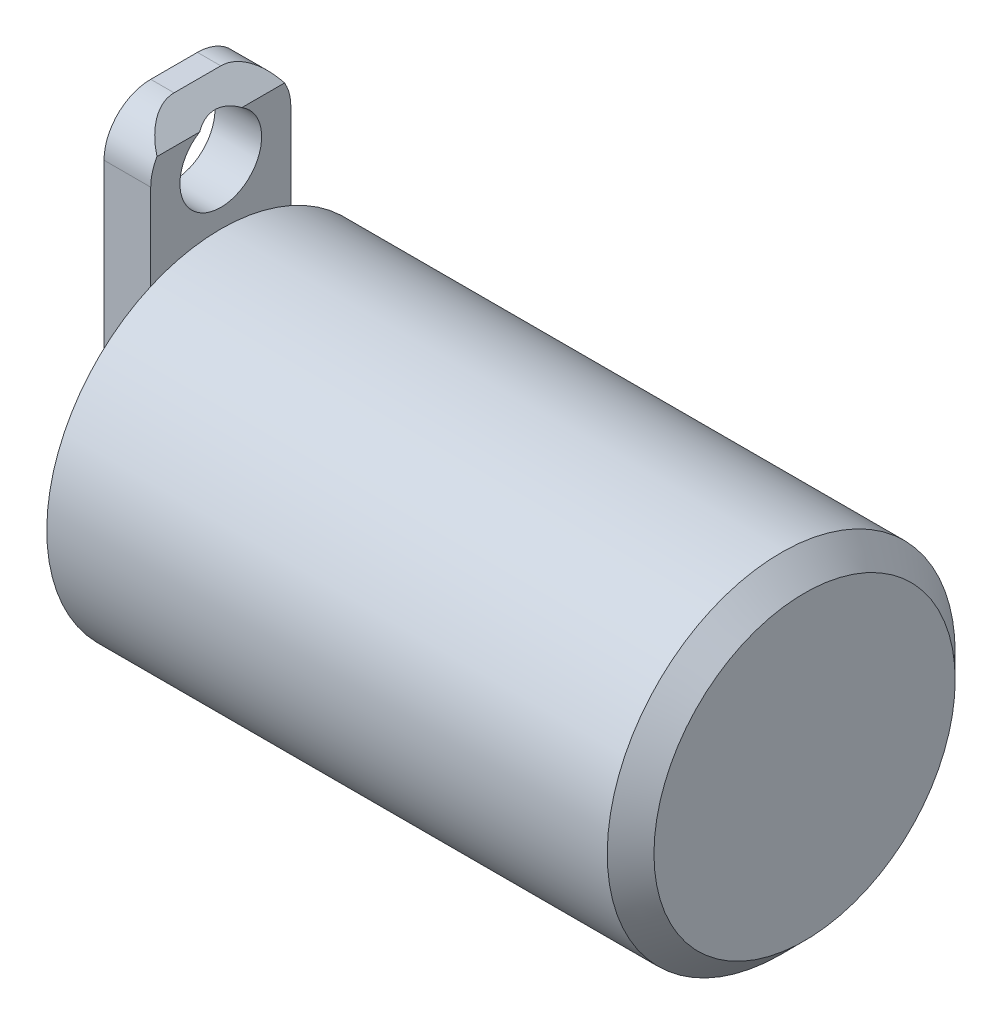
ISO-10303-21;
HEADER;
FILE_DESCRIPTION(('STEP AP214'),'2;1');
FILE_NAME('part.step','',(''),(''),'','','');
FILE_SCHEMA(('AUTOMOTIVE_DESIGN { 1 0 10303 214 1 1 1 1 }'));
ENDSEC;
DATA;
#1=APPLICATION_CONTEXT('core data for automotive mechanical design processes');
#2=APPLICATION_PROTOCOL_DEFINITION('international standard','automotive_design',2000,#1);
#3=PRODUCT_CONTEXT('',#1,'mechanical');
#4=PRODUCT('Part','Part','',(#3));
#5=PRODUCT_RELATED_PRODUCT_CATEGORY('part','',(#4));
#6=PRODUCT_DEFINITION_FORMATION('','',#4);
#7=PRODUCT_DEFINITION_CONTEXT('part definition',#1,'design');
#8=PRODUCT_DEFINITION('design','',#6,#7);
#9=PRODUCT_DEFINITION_SHAPE('','',#8);
#10=(LENGTH_UNIT() NAMED_UNIT(*) SI_UNIT(.MILLI.,.METRE.));
#11=(NAMED_UNIT(*) PLANE_ANGLE_UNIT() SI_UNIT($,.RADIAN.));
#12=(NAMED_UNIT(*) SI_UNIT($,.STERADIAN.) SOLID_ANGLE_UNIT());
#13=UNCERTAINTY_MEASURE_WITH_UNIT(LENGTH_MEASURE(1.E-05),#10,'distance_accuracy_value','');
#14=(GEOMETRIC_REPRESENTATION_CONTEXT(3) GLOBAL_UNCERTAINTY_ASSIGNED_CONTEXT((#13)) GLOBAL_UNIT_ASSIGNED_CONTEXT((#10,
#11,#12)) REPRESENTATION_CONTEXT('',''));
#15=CARTESIAN_POINT('',(0.,0.,0.));
#16=DIRECTION('',(0.,0.,1.));
#17=DIRECTION('',(1.,0.,0.));
#18=AXIS2_PLACEMENT_3D('',#15,#16,#17);
#19=CARTESIAN_POINT('',(0.,0.,0.));
#20=DIRECTION('',(1.,0.,0.));
#21=DIRECTION('',(0.,0.,-1.));
#22=AXIS2_PLACEMENT_3D('',#19,#20,#21);
#23=PLANE('',#22);
#24=DIRECTION('',(0.,-1.,0.));
#25=VECTOR('',#24,1.);
#26=CARTESIAN_POINT('',(0.,21.,-6.));
#27=LINE('',#26,#25);
#28=CARTESIAN_POINT('',(0.,13.6385483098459,-6.));
#29=VERTEX_POINT('',#28);
#30=CARTESIAN_POINT('',(0.,0.,-6.));
#31=VERTEX_POINT('',#30);
#32=EDGE_CURVE('E43',#29,#31,#27,.T.);
#33=ORIENTED_EDGE('',*,*,#32,.F.);
#34=CARTESIAN_POINT('',(0.,0.,0.));
#35=DIRECTION('',(1.,0.,0.));
#36=DIRECTION('',(0.,0.,-1.));
#37=AXIS2_PLACEMENT_3D('',#34,#35,#36);
#38=CIRCLE('',#37,14.9);
#39=CARTESIAN_POINT('',(0.,13.6385483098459,6.));
#40=VERTEX_POINT('',#39);
#41=EDGE_CURVE('E142',#40,#29,#38,.T.);
#42=ORIENTED_EDGE('',*,*,#41,.F.);
#43=DIRECTION('',(0.,1.,0.));
#44=VECTOR('',#43,1.);
#45=CARTESIAN_POINT('',(0.,0.,6.));
#46=LINE('',#45,#44);
#47=CARTESIAN_POINT('',(0.,0.,6.));
#48=VERTEX_POINT('',#47);
#49=EDGE_CURVE('E165',#48,#40,#46,.T.);
#50=ORIENTED_EDGE('',*,*,#49,.F.);
#51=DIRECTION('',(0.,0.,1.));
#52=VECTOR('',#51,1.);
#53=CARTESIAN_POINT('',(0.,0.,0.));
#54=LINE('',#53,#52);
#55=EDGE_CURVE('E57',#31,#48,#54,.T.);
#56=ORIENTED_EDGE('',*,*,#55,.F.);
#57=EDGE_LOOP('',(#33,#42,#50,#56));
#58=FACE_BOUND('',#57,.T.);
#59=ADVANCED_FACE('F35',(#58),#23,.F.);
#60=CARTESIAN_POINT('',(50.,0.,0.));
#61=DIRECTION('',(-1.,0.,0.));
#62=DIRECTION('',(0.,0.,1.));
#63=AXIS2_PLACEMENT_3D('',#60,#61,#62);
#64=CYLINDRICAL_SURFACE('',#63,14.9);
#65=CARTESIAN_POINT('',(48.,0.,0.));
#66=DIRECTION('',(1.,0.,0.));
#67=DIRECTION('',(0.,0.,-1.));
#68=AXIS2_PLACEMENT_3D('',#65,#66,#67);
#69=CIRCLE('',#68,14.9);
#70=CARTESIAN_POINT('',(48.,0.,-14.9));
#71=VERTEX_POINT('',#70);
#72=EDGE_CURVE('E147',#71,#71,#69,.F.);
#73=ORIENTED_EDGE('',*,*,#72,.T.);
#74=EDGE_LOOP('',(#73));
#75=FACE_BOUND('',#74,.T.);
#76=EDGE_CURVE('E143',#29,#40,#38,.T.);
#77=ORIENTED_EDGE('',*,*,#76,.T.);
#78=ORIENTED_EDGE('',*,*,#41,.T.);
#79=EDGE_LOOP('',(#77,#78));
#80=FACE_BOUND('',#79,.T.);
#81=ADVANCED_FACE('F212',(#75,#80),#64,.T.);
#82=CARTESIAN_POINT('',(50.,0.,0.));
#83=DIRECTION('',(1.,0.,0.));
#84=DIRECTION('',(0.,0.,-1.));
#85=AXIS2_PLACEMENT_3D('',#82,#83,#84);
#86=PLANE('',#85);
#87=CARTESIAN_POINT('',(50.,0.,0.));
#88=DIRECTION('',(1.,0.,0.));
#89=DIRECTION('',(0.,0.,-1.));
#90=AXIS2_PLACEMENT_3D('',#87,#88,#89);
#91=CIRCLE('',#90,12.9);
#92=CARTESIAN_POINT('',(50.,0.,-12.9));
#93=VERTEX_POINT('',#92);
#94=EDGE_CURVE('E145',#93,#93,#91,.T.);
#95=ORIENTED_EDGE('',*,*,#94,.T.);
#96=EDGE_LOOP('',(#95));
#97=FACE_BOUND('',#96,.T.);
#98=ADVANCED_FACE('F209',(#97),#86,.T.);
#99=CARTESIAN_POINT('',(50.,0.,0.));
#100=DIRECTION('',(-1.,0.,0.));
#101=DIRECTION('',(0.,0.,1.));
#102=AXIS2_PLACEMENT_3D('',#99,#100,#101);
#103=CONICAL_SURFACE('',#102,12.9,0.785398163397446);
#104=ORIENTED_EDGE('',*,*,#72,.F.);
#105=EDGE_LOOP('',(#104));
#106=FACE_BOUND('',#105,.T.);
#107=ORIENTED_EDGE('',*,*,#94,.F.);
#108=EDGE_LOOP('',(#107));
#109=FACE_BOUND('',#108,.T.);
#110=ADVANCED_FACE('F37',(#106,#109),#103,.T.);
#111=CARTESIAN_POINT('',(-4.,21.,2.));
#112=DIRECTION('',(-1.,0.,0.));
#113=DIRECTION('',(0.,0.,1.));
#114=AXIS2_PLACEMENT_3D('',#111,#112,#113);
#115=PLANE('',#114);
#116=DIRECTION('',(0.,0.,1.));
#117=VECTOR('',#116,1.);
#118=CARTESIAN_POINT('',(-4.,0.,-6.));
#119=LINE('',#118,#117);
#120=CARTESIAN_POINT('',(-4.,0.,-6.));
#121=VERTEX_POINT('',#120);
#122=CARTESIAN_POINT('',(-4.,0.,6.));
#123=VERTEX_POINT('',#122);
#124=EDGE_CURVE('E158',#121,#123,#119,.T.);
#125=ORIENTED_EDGE('',*,*,#124,.T.);
#126=DIRECTION('',(0.,1.,0.));
#127=VECTOR('',#126,1.);
#128=CARTESIAN_POINT('',(-4.,0.,6.));
#129=LINE('',#128,#127);
#130=CARTESIAN_POINT('',(-4.,21.,6.));
#131=VERTEX_POINT('',#130);
#132=EDGE_CURVE('E161',#123,#131,#129,.T.);
#133=ORIENTED_EDGE('',*,*,#132,.T.);
#134=CARTESIAN_POINT('',(-4.,21.,2.));
#135=DIRECTION('',(-1.,0.,0.));
#136=DIRECTION('',(0.,0.,1.));
#137=AXIS2_PLACEMENT_3D('',#134,#135,#136);
#138=CIRCLE('',#137,4.);
#139=CARTESIAN_POINT('',(-4.,25.,1.99999999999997));
#140=VERTEX_POINT('',#139);
#141=EDGE_CURVE('E178',#131,#140,#138,.T.);
#142=ORIENTED_EDGE('',*,*,#141,.T.);
#143=DIRECTION('',(0.,0.,-1.));
#144=VECTOR('',#143,1.);
#145=CARTESIAN_POINT('',(-4.,25.,1.99999999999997));
#146=LINE('',#145,#144);
#147=CARTESIAN_POINT('',(-4.,25.,-1.99999999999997));
#148=VERTEX_POINT('',#147);
#149=EDGE_CURVE('E176',#140,#148,#146,.T.);
#150=ORIENTED_EDGE('',*,*,#149,.T.);
#151=CARTESIAN_POINT('',(-4.,21.,-2.));
#152=DIRECTION('',(-1.,0.,0.));
#153=DIRECTION('',(0.,0.,1.));
#154=AXIS2_PLACEMENT_3D('',#151,#152,#153);
#155=CIRCLE('',#154,4.);
#156=CARTESIAN_POINT('',(-4.,21.,-6.));
#157=VERTEX_POINT('',#156);
#158=EDGE_CURVE('E127',#148,#157,#155,.T.);
#159=ORIENTED_EDGE('',*,*,#158,.T.);
#160=DIRECTION('',(0.,-1.,0.));
#161=VECTOR('',#160,1.);
#162=CARTESIAN_POINT('',(-4.,21.,-6.));
#163=LINE('',#162,#161);
#164=EDGE_CURVE('E173',#157,#121,#163,.T.);
#165=ORIENTED_EDGE('',*,*,#164,.T.);
#166=EDGE_LOOP('',(#125,#133,#142,#150,#159,#165));
#167=FACE_BOUND('',#166,.T.);
#168=CARTESIAN_POINT('',(-4.,20.,0.));
#169=DIRECTION('',(-1.,0.,0.));
#170=DIRECTION('',(0.,0.,1.));
#171=AXIS2_PLACEMENT_3D('',#168,#169,#170);
#172=CIRCLE('',#171,3.5);
#173=CARTESIAN_POINT('',(-4.,20.,3.5));
#174=VERTEX_POINT('',#173);
#175=EDGE_CURVE('E172',#174,#174,#172,.T.);
#176=ORIENTED_EDGE('',*,*,#175,.F.);
#177=EDGE_LOOP('',(#176));
#178=FACE_BOUND('',#177,.T.);
#179=ADVANCED_FACE('F199',(#167,#178),#115,.T.);
#180=CARTESIAN_POINT('',(0.,21.,2.));
#181=DIRECTION('',(-1.,0.,0.));
#182=DIRECTION('',(0.,0.,1.));
#183=AXIS2_PLACEMENT_3D('',#180,#181,#182);
#184=PLANE('',#183);
#185=CARTESIAN_POINT('',(0.,21.,-2.));
#186=DIRECTION('',(-1.,0.,0.));
#187=DIRECTION('',(0.,0.,1.));
#188=AXIS2_PLACEMENT_3D('',#185,#186,#187);
#189=CIRCLE('',#188,4.);
#190=CARTESIAN_POINT('',(0.,23.,-5.46410161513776));
#191=VERTEX_POINT('',#190);
#192=CARTESIAN_POINT('',(0.,21.,-6.));
#193=VERTEX_POINT('',#192);
#194=EDGE_CURVE('E159',#191,#193,#189,.T.);
#195=ORIENTED_EDGE('',*,*,#194,.F.);
#196=DIRECTION('',(0.,0.,1.));
#197=VECTOR('',#196,1.);
#198=CARTESIAN_POINT('',(0.,23.,-14.9));
#199=LINE('',#198,#197);
#200=CARTESIAN_POINT('',(0.,23.,-1.80277563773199));
#201=VERTEX_POINT('',#200);
#202=EDGE_CURVE('E109',#191,#201,#199,.T.);
#203=ORIENTED_EDGE('',*,*,#202,.T.);
#204=CARTESIAN_POINT('',(0.,20.,0.));
#205=DIRECTION('',(-1.,0.,0.));
#206=DIRECTION('',(0.,0.,1.));
#207=AXIS2_PLACEMENT_3D('',#204,#205,#206);
#208=CIRCLE('',#207,3.5);
#209=CARTESIAN_POINT('',(0.,23.,1.80277563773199));
#210=VERTEX_POINT('',#209);
#211=EDGE_CURVE('E181',#201,#210,#208,.T.);
#212=ORIENTED_EDGE('',*,*,#211,.T.);
#213=CARTESIAN_POINT('',(0.,23.,5.46410161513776));
#214=VERTEX_POINT('',#213);
#215=EDGE_CURVE('E49',#210,#214,#199,.T.);
#216=ORIENTED_EDGE('',*,*,#215,.T.);
#217=CARTESIAN_POINT('',(0.,21.,2.));
#218=DIRECTION('',(-1.,0.,0.));
#219=DIRECTION('',(0.,0.,1.));
#220=AXIS2_PLACEMENT_3D('',#217,#218,#219);
#221=CIRCLE('',#220,4.);
#222=CARTESIAN_POINT('',(0.,21.,6.));
#223=VERTEX_POINT('',#222);
#224=EDGE_CURVE('E163',#223,#214,#221,.T.);
#225=ORIENTED_EDGE('',*,*,#224,.F.);
#226=EDGE_CURVE('E170',#40,#223,#46,.T.);
#227=ORIENTED_EDGE('',*,*,#226,.F.);
#228=ORIENTED_EDGE('',*,*,#76,.F.);
#229=EDGE_CURVE('E152',#193,#29,#27,.T.);
#230=ORIENTED_EDGE('',*,*,#229,.F.);
#231=EDGE_LOOP('',(#195,#203,#212,#216,#225,#227,#228,#230));
#232=FACE_BOUND('',#231,.T.);
#233=ADVANCED_FACE('F190',(#232),#184,.F.);
#234=CARTESIAN_POINT('',(-4.,0.,0.));
#235=DIRECTION('',(0.,1.,0.));
#236=DIRECTION('',(0.,0.,1.));
#237=AXIS2_PLACEMENT_3D('',#234,#235,#236);
#238=PLANE('',#237);
#239=ORIENTED_EDGE('',*,*,#55,.T.);
#240=DIRECTION('',(1.,0.,0.));
#241=VECTOR('',#240,1.);
#242=CARTESIAN_POINT('',(-4.,0.,6.));
#243=LINE('',#242,#241);
#244=EDGE_CURVE('E139',#123,#48,#243,.T.);
#245=ORIENTED_EDGE('',*,*,#244,.F.);
#246=ORIENTED_EDGE('',*,*,#124,.F.);
#247=DIRECTION('',(1.,0.,0.));
#248=VECTOR('',#247,1.);
#249=CARTESIAN_POINT('',(-4.,0.,-6.));
#250=LINE('',#249,#248);
#251=EDGE_CURVE('E133',#121,#31,#250,.T.);
#252=ORIENTED_EDGE('',*,*,#251,.T.);
#253=EDGE_LOOP('',(#239,#245,#246,#252));
#254=FACE_BOUND('',#253,.T.);
#255=ADVANCED_FACE('F207',(#254),#238,.F.);
#256=CARTESIAN_POINT('',(-4.,0.,6.));
#257=DIRECTION('',(0.,0.,-1.));
#258=DIRECTION('',(0.,1.,0.));
#259=AXIS2_PLACEMENT_3D('',#256,#257,#258);
#260=PLANE('',#259);
#261=ORIENTED_EDGE('',*,*,#49,.T.);
#262=ORIENTED_EDGE('',*,*,#226,.T.);
#263=DIRECTION('',(1.,0.,0.));
#264=VECTOR('',#263,1.);
#265=CARTESIAN_POINT('',(-4.,21.,6.));
#266=LINE('',#265,#264);
#267=EDGE_CURVE('E130',#131,#223,#266,.T.);
#268=ORIENTED_EDGE('',*,*,#267,.F.);
#269=ORIENTED_EDGE('',*,*,#132,.F.);
#270=ORIENTED_EDGE('',*,*,#244,.T.);
#271=EDGE_LOOP('',(#261,#262,#268,#269,#270));
#272=FACE_BOUND('',#271,.T.);
#273=ADVANCED_FACE('F223',(#272),#260,.F.);
#274=CARTESIAN_POINT('',(-4.,21.,2.));
#275=DIRECTION('',(1.,0.,0.));
#276=DIRECTION('',(0.,0.,-1.));
#277=AXIS2_PLACEMENT_3D('',#274,#275,#276);
#278=CYLINDRICAL_SURFACE('',#277,4.);
#279=ORIENTED_EDGE('',*,*,#224,.T.);
#280=CARTESIAN_POINT('',(2.00000000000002,21.,2.));
#281=DIRECTION('',(-0.707106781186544,-0.707106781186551,0.));
#282=DIRECTION('',(0.707106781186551,-0.707106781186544,0.));
#283=AXIS2_PLACEMENT_3D('',#280,#281,#282);
#284=ELLIPSE('',#283,5.65685424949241,4.);
#285=CARTESIAN_POINT('',(-2.00000000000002,25.,1.99999999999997));
#286=VERTEX_POINT('',#285);
#287=EDGE_CURVE('E113',#214,#286,#284,.T.);
#288=ORIENTED_EDGE('',*,*,#287,.T.);
#289=DIRECTION('',(1.,0.,0.));
#290=VECTOR('',#289,1.);
#291=CARTESIAN_POINT('',(-4.,25.,1.99999999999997));
#292=LINE('',#291,#290);
#293=EDGE_CURVE('E123',#140,#286,#292,.T.);
#294=ORIENTED_EDGE('',*,*,#293,.F.);
#295=ORIENTED_EDGE('',*,*,#141,.F.);
#296=ORIENTED_EDGE('',*,*,#267,.T.);
#297=EDGE_LOOP('',(#279,#288,#294,#295,#296));
#298=FACE_BOUND('',#297,.T.);
#299=ADVANCED_FACE('F227',(#298),#278,.T.);
#300=CARTESIAN_POINT('',(-4.,25.,1.99999999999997));
#301=DIRECTION('',(0.,-1.,0.));
#302=DIRECTION('',(0.,0.,-1.));
#303=AXIS2_PLACEMENT_3D('',#300,#301,#302);
#304=PLANE('',#303);
#305=ORIENTED_EDGE('',*,*,#293,.T.);
#306=DIRECTION('',(0.,0.,1.));
#307=VECTOR('',#306,1.);
#308=CARTESIAN_POINT('',(-2.00000000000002,25.,-14.9));
#309=LINE('',#308,#307);
#310=CARTESIAN_POINT('',(-2.00000000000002,25.,-2.));
#311=VERTEX_POINT('',#310);
#312=EDGE_CURVE('E106',#311,#286,#309,.T.);
#313=ORIENTED_EDGE('',*,*,#312,.F.);
#314=DIRECTION('',(1.,0.,0.));
#315=VECTOR('',#314,1.);
#316=CARTESIAN_POINT('',(-4.,25.,-1.99999999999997));
#317=LINE('',#316,#315);
#318=EDGE_CURVE('E120',#148,#311,#317,.T.);
#319=ORIENTED_EDGE('',*,*,#318,.F.);
#320=ORIENTED_EDGE('',*,*,#149,.F.);
#321=EDGE_LOOP('',(#305,#313,#319,#320));
#322=FACE_BOUND('',#321,.T.);
#323=ADVANCED_FACE('F118',(#322),#304,.F.);
#324=CARTESIAN_POINT('',(-4.,21.,-2.));
#325=DIRECTION('',(1.,0.,0.));
#326=DIRECTION('',(0.,0.,-1.));
#327=AXIS2_PLACEMENT_3D('',#324,#325,#326);
#328=CYLINDRICAL_SURFACE('',#327,4.);
#329=ORIENTED_EDGE('',*,*,#318,.T.);
#330=CARTESIAN_POINT('',(2.00000000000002,21.,-2.));
#331=DIRECTION('',(-0.707106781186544,-0.707106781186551,0.));
#332=DIRECTION('',(0.707106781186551,-0.707106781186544,0.));
#333=AXIS2_PLACEMENT_3D('',#330,#331,#332);
#334=ELLIPSE('',#333,5.65685424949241,4.);
#335=EDGE_CURVE('E103',#311,#191,#334,.T.);
#336=ORIENTED_EDGE('',*,*,#335,.T.);
#337=ORIENTED_EDGE('',*,*,#194,.T.);
#338=DIRECTION('',(1.,0.,0.));
#339=VECTOR('',#338,1.);
#340=CARTESIAN_POINT('',(-4.,21.,-6.));
#341=LINE('',#340,#339);
#342=EDGE_CURVE('E128',#157,#193,#341,.T.);
#343=ORIENTED_EDGE('',*,*,#342,.F.);
#344=ORIENTED_EDGE('',*,*,#158,.F.);
#345=EDGE_LOOP('',(#329,#336,#337,#343,#344));
#346=FACE_BOUND('',#345,.T.);
#347=ADVANCED_FACE('F125',(#346),#328,.T.);
#348=CARTESIAN_POINT('',(-4.,21.,-6.));
#349=DIRECTION('',(0.,0.,1.));
#350=DIRECTION('',(0.,-1.,0.));
#351=AXIS2_PLACEMENT_3D('',#348,#349,#350);
#352=PLANE('',#351);
#353=ORIENTED_EDGE('',*,*,#229,.T.);
#354=ORIENTED_EDGE('',*,*,#32,.T.);
#355=ORIENTED_EDGE('',*,*,#251,.F.);
#356=ORIENTED_EDGE('',*,*,#164,.F.);
#357=ORIENTED_EDGE('',*,*,#342,.T.);
#358=EDGE_LOOP('',(#353,#354,#355,#356,#357));
#359=FACE_BOUND('',#358,.T.);
#360=ADVANCED_FACE('F195',(#359),#352,.F.);
#361=CARTESIAN_POINT('',(-4.,20.,0.));
#362=DIRECTION('',(1.,0.,0.));
#363=DIRECTION('',(0.,0.,-1.));
#364=AXIS2_PLACEMENT_3D('',#361,#362,#363);
#365=CYLINDRICAL_SURFACE('',#364,3.5);
#366=CARTESIAN_POINT('',(3.00000000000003,20.,0.));
#367=DIRECTION('',(-0.707106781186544,-0.707106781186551,0.));
#368=DIRECTION('',(0.707106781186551,-0.707106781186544,0.));
#369=AXIS2_PLACEMENT_3D('',#366,#367,#368);
#370=ELLIPSE('',#369,4.94974746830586,3.5);
#371=EDGE_CURVE('E11',#210,#201,#370,.T.);
#372=ORIENTED_EDGE('',*,*,#371,.F.);
#373=ORIENTED_EDGE('',*,*,#211,.F.);
#374=EDGE_LOOP('',(#372,#373));
#375=FACE_BOUND('',#374,.T.);
#376=ORIENTED_EDGE('',*,*,#175,.T.);
#377=EDGE_LOOP('',(#376));
#378=FACE_BOUND('',#377,.T.);
#379=ADVANCED_FACE('F192',(#375,#378),#365,.F.);
#380=CARTESIAN_POINT('',(-2.00000000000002,25.,-14.9));
#381=DIRECTION('',(-0.707106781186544,-0.707106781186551,0.));
#382=DIRECTION('',(0.707106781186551,-0.707106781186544,0.));
#383=AXIS2_PLACEMENT_3D('',#380,#381,#382);
#384=PLANE('',#383);
#385=ORIENTED_EDGE('',*,*,#215,.F.);
#386=ORIENTED_EDGE('',*,*,#371,.T.);
#387=ORIENTED_EDGE('',*,*,#202,.F.);
#388=ORIENTED_EDGE('',*,*,#335,.F.);
#389=ORIENTED_EDGE('',*,*,#312,.T.);
#390=ORIENTED_EDGE('',*,*,#287,.F.);
#391=EDGE_LOOP('',(#385,#386,#387,#388,#389,#390));
#392=FACE_BOUND('',#391,.T.);
#393=ADVANCED_FACE('F105',(#392),#384,.F.);
#394=CLOSED_SHELL('',(#59,#81,#98,#110,#179,#233,#255,#273,#299,#323,#347,#360,#379,#393));
#395=MANIFOLD_SOLID_BREP('B2',#394);
#396=ADVANCED_BREP_SHAPE_REPRESENTATION('',(#18,#395),#14);
#397=SHAPE_DEFINITION_REPRESENTATION(#9,#396);
ENDSEC;
END-ISO-10303-21;
